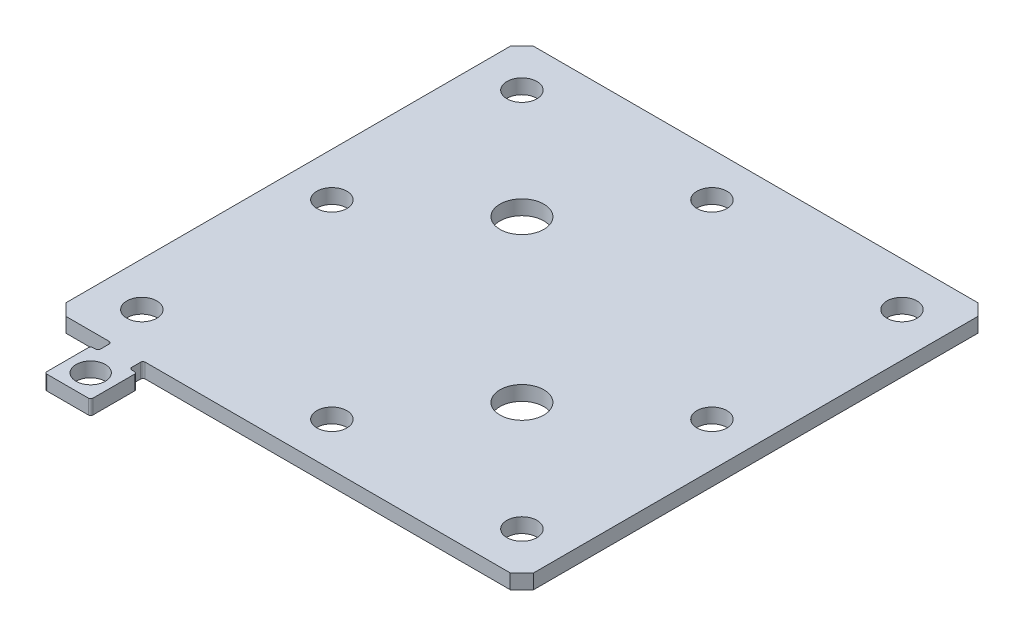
ISO-10303-21;
HEADER;
FILE_DESCRIPTION(('STEP AP214'),'2;1');
FILE_NAME('part.step','',(''),(''),'','','');
FILE_SCHEMA(('AUTOMOTIVE_DESIGN { 1 0 10303 214 1 1 1 1 }'));
ENDSEC;
DATA;
#1=APPLICATION_CONTEXT('core data for automotive mechanical design processes');
#2=APPLICATION_PROTOCOL_DEFINITION('international standard','automotive_design',2000,#1);
#3=PRODUCT_CONTEXT('',#1,'mechanical');
#4=PRODUCT('Part','Part','',(#3));
#5=PRODUCT_RELATED_PRODUCT_CATEGORY('part','',(#4));
#6=PRODUCT_DEFINITION_FORMATION('','',#4);
#7=PRODUCT_DEFINITION_CONTEXT('part definition',#1,'design');
#8=PRODUCT_DEFINITION('design','',#6,#7);
#9=PRODUCT_DEFINITION_SHAPE('','',#8);
#10=(LENGTH_UNIT() NAMED_UNIT(*) SI_UNIT(.MILLI.,.METRE.));
#11=(NAMED_UNIT(*) PLANE_ANGLE_UNIT() SI_UNIT($,.RADIAN.));
#12=(NAMED_UNIT(*) SI_UNIT($,.STERADIAN.) SOLID_ANGLE_UNIT());
#13=UNCERTAINTY_MEASURE_WITH_UNIT(LENGTH_MEASURE(1.E-05),#10,'distance_accuracy_value','');
#14=(GEOMETRIC_REPRESENTATION_CONTEXT(3) GLOBAL_UNCERTAINTY_ASSIGNED_CONTEXT((#13)) GLOBAL_UNIT_ASSIGNED_CONTEXT((#10,
#11,#12)) REPRESENTATION_CONTEXT('',''));
#15=CARTESIAN_POINT('',(0.,0.,0.));
#16=DIRECTION('',(0.,0.,1.));
#17=DIRECTION('',(1.,0.,0.));
#18=AXIS2_PLACEMENT_3D('',#15,#16,#17);
#19=CARTESIAN_POINT('',(-32.1361294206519,3.175,0.));
#20=DIRECTION('',(-1.,0.,0.));
#21=DIRECTION('',(0.,0.,1.));
#22=AXIS2_PLACEMENT_3D('',#19,#20,#21);
#23=PLANE('',#22);
#24=DIRECTION('',(0.,0.,-1.));
#25=VECTOR('',#24,1.);
#26=CARTESIAN_POINT('',(-32.1361294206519,3.175,0.));
#27=LINE('',#26,#25);
#28=CARTESIAN_POINT('',(-32.1361294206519,3.175,52.6144040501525));
#29=VERTEX_POINT('',#28);
#30=CARTESIAN_POINT('',(-32.1361294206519,3.175,50.676370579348));
#31=VERTEX_POINT('',#30);
#32=EDGE_CURVE('E212',#29,#31,#27,.T.);
#33=ORIENTED_EDGE('',*,*,#32,.F.);
#34=DIRECTION('',(0.,-1.,0.));
#35=VECTOR('',#34,1.);
#36=CARTESIAN_POINT('',(-32.1361294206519,3.175,52.6144040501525));
#37=LINE('',#36,#35);
#38=CARTESIAN_POINT('',(-32.1361294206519,0.,52.6144040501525));
#39=VERTEX_POINT('',#38);
#40=EDGE_CURVE('E384',#29,#39,#37,.T.);
#41=ORIENTED_EDGE('',*,*,#40,.T.);
#42=DIRECTION('',(0.,0.,-1.));
#43=VECTOR('',#42,1.);
#44=CARTESIAN_POINT('',(-32.1361294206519,0.,0.));
#45=LINE('',#44,#43);
#46=CARTESIAN_POINT('',(-32.1361294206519,0.,50.676370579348));
#47=VERTEX_POINT('',#46);
#48=EDGE_CURVE('E291',#39,#47,#45,.T.);
#49=ORIENTED_EDGE('',*,*,#48,.T.);
#50=DIRECTION('',(0.,-1.,0.));
#51=VECTOR('',#50,1.);
#52=CARTESIAN_POINT('',(-32.1361294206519,3.175,50.676370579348));
#53=LINE('',#52,#51);
#54=EDGE_CURVE('E382',#47,#31,#53,.F.);
#55=ORIENTED_EDGE('',*,*,#54,.T.);
#56=EDGE_LOOP('',(#33,#41,#49,#55));
#57=FACE_BOUND('',#56,.T.);
#58=ADVANCED_FACE('F39',(#57),#23,.F.);
#59=CARTESIAN_POINT('',(0.,3.175,50.176370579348));
#60=DIRECTION('',(0.,0.,-1.));
#61=DIRECTION('',(-1.,0.,0.));
#62=AXIS2_PLACEMENT_3D('',#59,#60,#61);
#63=PLANE('',#62);
#64=DIRECTION('',(1.,0.,0.));
#65=VECTOR('',#64,1.);
#66=CARTESIAN_POINT('',(0.,3.175,50.176370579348));
#67=LINE('',#66,#65);
#68=CARTESIAN_POINT('',(-31.6361294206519,3.175,50.176370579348));
#69=VERTEX_POINT('',#68);
#70=CARTESIAN_POINT('',(47.636370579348,3.175,50.176370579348));
#71=VERTEX_POINT('',#70);
#72=EDGE_CURVE('E199',#69,#71,#67,.T.);
#73=ORIENTED_EDGE('',*,*,#72,.F.);
#74=DIRECTION('',(0.,-1.,0.));
#75=VECTOR('',#74,1.);
#76=CARTESIAN_POINT('',(-31.6361294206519,0.,50.176370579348));
#77=LINE('',#76,#75);
#78=CARTESIAN_POINT('',(-31.6361294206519,0.,50.176370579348));
#79=VERTEX_POINT('',#78);
#80=EDGE_CURVE('E387',#69,#79,#77,.T.);
#81=ORIENTED_EDGE('',*,*,#80,.T.);
#82=DIRECTION('',(1.,0.,0.));
#83=VECTOR('',#82,1.);
#84=CARTESIAN_POINT('',(0.,0.,50.176370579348));
#85=LINE('',#84,#83);
#86=CARTESIAN_POINT('',(47.636370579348,0.,50.176370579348));
#87=VERTEX_POINT('',#86);
#88=EDGE_CURVE('E218',#79,#87,#85,.T.);
#89=ORIENTED_EDGE('',*,*,#88,.T.);
#90=DIRECTION('',(0.,-1.,0.));
#91=VECTOR('',#90,1.);
#92=CARTESIAN_POINT('',(47.636370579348,3.175,50.176370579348));
#93=LINE('',#92,#91);
#94=EDGE_CURVE('E215',#71,#87,#93,.T.);
#95=ORIENTED_EDGE('',*,*,#94,.F.);
#96=EDGE_LOOP('',(#73,#81,#89,#95));
#97=FACE_BOUND('',#96,.T.);
#98=ADVANCED_FACE('F216',(#97),#63,.F.);
#99=CARTESIAN_POINT('',(48.906370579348,3.175,48.906370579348));
#100=DIRECTION('',(-0.707106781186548,0.,-0.707106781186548));
#101=DIRECTION('',(-0.707106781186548,0.,0.707106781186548));
#102=AXIS2_PLACEMENT_3D('',#99,#100,#101);
#103=PLANE('',#102);
#104=DIRECTION('',(0.707106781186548,0.,-0.707106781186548));
#105=VECTOR('',#104,1.);
#106=CARTESIAN_POINT('',(48.906370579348,0.,48.906370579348));
#107=LINE('',#106,#105);
#108=CARTESIAN_POINT('',(50.176370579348,0.,47.636370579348));
#109=VERTEX_POINT('',#108);
#110=EDGE_CURVE('E295',#87,#109,#107,.T.);
#111=ORIENTED_EDGE('',*,*,#110,.T.);
#112=DIRECTION('',(0.,-1.,0.));
#113=VECTOR('',#112,1.);
#114=CARTESIAN_POINT('',(50.176370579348,3.175,47.636370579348));
#115=LINE('',#114,#113);
#116=CARTESIAN_POINT('',(50.176370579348,3.175,47.636370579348));
#117=VERTEX_POINT('',#116);
#118=EDGE_CURVE('E222',#117,#109,#115,.T.);
#119=ORIENTED_EDGE('',*,*,#118,.F.);
#120=DIRECTION('',(0.707106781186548,0.,-0.707106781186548));
#121=VECTOR('',#120,1.);
#122=CARTESIAN_POINT('',(48.906370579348,3.175,48.906370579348));
#123=LINE('',#122,#121);
#124=EDGE_CURVE('E204',#71,#117,#123,.T.);
#125=ORIENTED_EDGE('',*,*,#124,.F.);
#126=ORIENTED_EDGE('',*,*,#94,.T.);
#127=EDGE_LOOP('',(#111,#119,#125,#126));
#128=FACE_BOUND('',#127,.T.);
#129=ADVANCED_FACE('F224',(#128),#103,.F.);
#130=CARTESIAN_POINT('',(50.176370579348,3.175,0.));
#131=DIRECTION('',(-1.,0.,0.));
#132=DIRECTION('',(0.,0.,1.));
#133=AXIS2_PLACEMENT_3D('',#130,#131,#132);
#134=PLANE('',#133);
#135=DIRECTION('',(0.,0.,-1.));
#136=VECTOR('',#135,1.);
#137=CARTESIAN_POINT('',(50.176370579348,0.,0.));
#138=LINE('',#137,#136);
#139=CARTESIAN_POINT('',(50.176370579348,0.,-48.883629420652));
#140=VERTEX_POINT('',#139);
#141=EDGE_CURVE('E297',#109,#140,#138,.T.);
#142=ORIENTED_EDGE('',*,*,#141,.T.);
#143=DIRECTION('',(0.,-1.,0.));
#144=VECTOR('',#143,1.);
#145=CARTESIAN_POINT('',(50.176370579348,3.175,-48.883629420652));
#146=LINE('',#145,#144);
#147=CARTESIAN_POINT('',(50.176370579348,3.175,-48.883629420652));
#148=VERTEX_POINT('',#147);
#149=EDGE_CURVE('E346',#148,#140,#146,.T.);
#150=ORIENTED_EDGE('',*,*,#149,.F.);
#151=DIRECTION('',(0.,0.,-1.));
#152=VECTOR('',#151,1.);
#153=CARTESIAN_POINT('',(50.176370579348,3.175,0.));
#154=LINE('',#153,#152);
#155=EDGE_CURVE('E227',#117,#148,#154,.T.);
#156=ORIENTED_EDGE('',*,*,#155,.F.);
#157=ORIENTED_EDGE('',*,*,#118,.T.);
#158=EDGE_LOOP('',(#142,#150,#156,#157));
#159=FACE_BOUND('',#158,.T.);
#160=ADVANCED_FACE('F910',(#159),#134,.F.);
#161=CARTESIAN_POINT('',(49.53,3.175,-49.53));
#162=DIRECTION('',(0.707106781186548,0.,-0.707106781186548));
#163=DIRECTION('',(-0.707106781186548,0.,-0.707106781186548));
#164=AXIS2_PLACEMENT_3D('',#161,#162,#163);
#165=PLANE('',#164);
#166=DIRECTION('',(0.707106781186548,0.,0.707106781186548));
#167=VECTOR('',#166,1.);
#168=CARTESIAN_POINT('',(49.53,0.,-49.53));
#169=LINE('',#168,#167);
#170=CARTESIAN_POINT('',(47.636370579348,0.,-51.423629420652));
#171=VERTEX_POINT('',#170);
#172=EDGE_CURVE('E300',#171,#140,#169,.T.);
#173=ORIENTED_EDGE('',*,*,#172,.F.);
#174=DIRECTION('',(0.,-1.,0.));
#175=VECTOR('',#174,1.);
#176=CARTESIAN_POINT('',(47.636370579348,3.175,-51.423629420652));
#177=LINE('',#176,#175);
#178=CARTESIAN_POINT('',(47.636370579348,3.175,-51.423629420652));
#179=VERTEX_POINT('',#178);
#180=EDGE_CURVE('E344',#179,#171,#177,.T.);
#181=ORIENTED_EDGE('',*,*,#180,.F.);
#182=DIRECTION('',(0.707106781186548,0.,0.707106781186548));
#183=VECTOR('',#182,1.);
#184=CARTESIAN_POINT('',(49.53,3.175,-49.53));
#185=LINE('',#184,#183);
#186=EDGE_CURVE('E229',#179,#148,#185,.T.);
#187=ORIENTED_EDGE('',*,*,#186,.T.);
#188=ORIENTED_EDGE('',*,*,#149,.T.);
#189=EDGE_LOOP('',(#173,#181,#187,#188));
#190=FACE_BOUND('',#189,.T.);
#191=ADVANCED_FACE('F899',(#190),#165,.T.);
#192=CARTESIAN_POINT('',(0.,3.175,-51.423629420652));
#193=DIRECTION('',(0.,0.,-1.));
#194=DIRECTION('',(-1.,0.,0.));
#195=AXIS2_PLACEMENT_3D('',#192,#193,#194);
#196=PLANE('',#195);
#197=DIRECTION('',(1.,0.,0.));
#198=VECTOR('',#197,1.);
#199=CARTESIAN_POINT('',(0.,0.,-51.423629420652));
#200=LINE('',#199,#198);
#201=CARTESIAN_POINT('',(-48.883629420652,0.,-51.423629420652));
#202=VERTEX_POINT('',#201);
#203=EDGE_CURVE('E303',#202,#171,#200,.T.);
#204=ORIENTED_EDGE('',*,*,#203,.F.);
#205=DIRECTION('',(0.,-1.,0.));
#206=VECTOR('',#205,1.);
#207=CARTESIAN_POINT('',(-48.883629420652,3.175,-51.423629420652));
#208=LINE('',#207,#206);
#209=CARTESIAN_POINT('',(-48.883629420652,3.175,-51.423629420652));
#210=VERTEX_POINT('',#209);
#211=EDGE_CURVE('E342',#210,#202,#208,.T.);
#212=ORIENTED_EDGE('',*,*,#211,.F.);
#213=DIRECTION('',(1.,0.,0.));
#214=VECTOR('',#213,1.);
#215=CARTESIAN_POINT('',(0.,3.175,-51.423629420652));
#216=LINE('',#215,#214);
#217=EDGE_CURVE('E235',#210,#179,#216,.T.);
#218=ORIENTED_EDGE('',*,*,#217,.T.);
#219=ORIENTED_EDGE('',*,*,#180,.T.);
#220=EDGE_LOOP('',(#204,#212,#218,#219));
#221=FACE_BOUND('',#220,.T.);
#222=ADVANCED_FACE('F888',(#221),#196,.T.);
#223=CARTESIAN_POINT('',(-50.153629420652,3.175,-50.153629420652));
#224=DIRECTION('',(-0.707106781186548,0.,-0.707106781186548));
#225=DIRECTION('',(-0.707106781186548,0.,0.707106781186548));
#226=AXIS2_PLACEMENT_3D('',#223,#224,#225);
#227=PLANE('',#226);
#228=DIRECTION('',(0.707106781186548,0.,-0.707106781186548));
#229=VECTOR('',#228,1.);
#230=CARTESIAN_POINT('',(-50.153629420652,0.,-50.153629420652));
#231=LINE('',#230,#229);
#232=CARTESIAN_POINT('',(-51.423629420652,0.,-48.883629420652));
#233=VERTEX_POINT('',#232);
#234=EDGE_CURVE('E306',#233,#202,#231,.T.);
#235=ORIENTED_EDGE('',*,*,#234,.F.);
#236=DIRECTION('',(0.,-1.,0.));
#237=VECTOR('',#236,1.);
#238=CARTESIAN_POINT('',(-51.423629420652,3.175,-48.883629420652));
#239=LINE('',#238,#237);
#240=CARTESIAN_POINT('',(-51.423629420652,3.175,-48.883629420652));
#241=VERTEX_POINT('',#240);
#242=EDGE_CURVE('E340',#241,#233,#239,.T.);
#243=ORIENTED_EDGE('',*,*,#242,.F.);
#244=DIRECTION('',(0.707106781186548,0.,-0.707106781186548));
#245=VECTOR('',#244,1.);
#246=CARTESIAN_POINT('',(-50.153629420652,3.175,-50.153629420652));
#247=LINE('',#246,#245);
#248=EDGE_CURVE('E238',#241,#210,#247,.T.);
#249=ORIENTED_EDGE('',*,*,#248,.T.);
#250=ORIENTED_EDGE('',*,*,#211,.T.);
#251=EDGE_LOOP('',(#235,#243,#249,#250));
#252=FACE_BOUND('',#251,.T.);
#253=ADVANCED_FACE('F877',(#252),#227,.T.);
#254=CARTESIAN_POINT('',(-51.423629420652,3.175,0.));
#255=DIRECTION('',(-1.,0.,0.));
#256=DIRECTION('',(0.,0.,1.));
#257=AXIS2_PLACEMENT_3D('',#254,#255,#256);
#258=PLANE('',#257);
#259=DIRECTION('',(0.,0.,-1.));
#260=VECTOR('',#259,1.);
#261=CARTESIAN_POINT('',(-51.423629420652,0.,0.));
#262=LINE('',#261,#260);
#263=CARTESIAN_POINT('',(-51.423629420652,0.,47.636370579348));
#264=VERTEX_POINT('',#263);
#265=EDGE_CURVE('E309',#264,#233,#262,.T.);
#266=ORIENTED_EDGE('',*,*,#265,.F.);
#267=DIRECTION('',(0.,-1.,0.));
#268=VECTOR('',#267,1.);
#269=CARTESIAN_POINT('',(-51.423629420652,3.175,47.636370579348));
#270=LINE('',#269,#268);
#271=CARTESIAN_POINT('',(-51.423629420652,3.175,47.636370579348));
#272=VERTEX_POINT('',#271);
#273=EDGE_CURVE('E338',#272,#264,#270,.T.);
#274=ORIENTED_EDGE('',*,*,#273,.F.);
#275=DIRECTION('',(0.,0.,-1.));
#276=VECTOR('',#275,1.);
#277=CARTESIAN_POINT('',(-51.423629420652,3.175,0.));
#278=LINE('',#277,#276);
#279=EDGE_CURVE('E241',#272,#241,#278,.T.);
#280=ORIENTED_EDGE('',*,*,#279,.T.);
#281=ORIENTED_EDGE('',*,*,#242,.T.);
#282=EDGE_LOOP('',(#266,#274,#280,#281));
#283=FACE_BOUND('',#282,.T.);
#284=ADVANCED_FACE('F866',(#283),#258,.T.);
#285=CARTESIAN_POINT('',(-49.53,3.175,49.53));
#286=DIRECTION('',(0.707106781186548,0.,-0.707106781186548));
#287=DIRECTION('',(-0.707106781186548,0.,-0.707106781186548));
#288=AXIS2_PLACEMENT_3D('',#285,#286,#287);
#289=PLANE('',#288);
#290=DIRECTION('',(0.707106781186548,0.,0.707106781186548));
#291=VECTOR('',#290,1.);
#292=CARTESIAN_POINT('',(-49.53,0.,49.53));
#293=LINE('',#292,#291);
#294=CARTESIAN_POINT('',(-48.883629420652,0.,50.176370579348));
#295=VERTEX_POINT('',#294);
#296=EDGE_CURVE('E312',#264,#295,#293,.T.);
#297=ORIENTED_EDGE('',*,*,#296,.T.);
#298=DIRECTION('',(0.,-1.,0.));
#299=VECTOR('',#298,1.);
#300=CARTESIAN_POINT('',(-48.883629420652,3.175,50.176370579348));
#301=LINE('',#300,#299);
#302=CARTESIAN_POINT('',(-48.883629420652,3.175,50.176370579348));
#303=VERTEX_POINT('',#302);
#304=EDGE_CURVE('E265',#303,#295,#301,.T.);
#305=ORIENTED_EDGE('',*,*,#304,.F.);
#306=DIRECTION('',(0.707106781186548,0.,0.707106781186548));
#307=VECTOR('',#306,1.);
#308=CARTESIAN_POINT('',(-49.53,3.175,49.53));
#309=LINE('',#308,#307);
#310=EDGE_CURVE('E244',#272,#303,#309,.T.);
#311=ORIENTED_EDGE('',*,*,#310,.F.);
#312=ORIENTED_EDGE('',*,*,#273,.T.);
#313=EDGE_LOOP('',(#297,#305,#311,#312));
#314=FACE_BOUND('',#313,.T.);
#315=ADVANCED_FACE('F856',(#314),#289,.F.);
#316=CARTESIAN_POINT('',(0.,3.175,50.176370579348));
#317=DIRECTION('',(0.,0.,-1.));
#318=DIRECTION('',(-1.,0.,0.));
#319=AXIS2_PLACEMENT_3D('',#316,#317,#318);
#320=PLANE('',#319);
#321=DIRECTION('',(1.,0.,0.));
#322=VECTOR('',#321,1.);
#323=CARTESIAN_POINT('',(0.,0.,50.176370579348));
#324=LINE('',#323,#322);
#325=CARTESIAN_POINT('',(-39.461129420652,0.,50.176370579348));
#326=VERTEX_POINT('',#325);
#327=EDGE_CURVE('E314',#295,#326,#324,.T.);
#328=ORIENTED_EDGE('',*,*,#327,.T.);
#329=DIRECTION('',(0.,-1.,0.));
#330=VECTOR('',#329,1.);
#331=CARTESIAN_POINT('',(-39.461129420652,3.175,50.176370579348));
#332=LINE('',#331,#330);
#333=CARTESIAN_POINT('',(-39.461129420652,3.175,50.176370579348));
#334=VERTEX_POINT('',#333);
#335=EDGE_CURVE('E399',#326,#334,#332,.F.);
#336=ORIENTED_EDGE('',*,*,#335,.T.);
#337=DIRECTION('',(1.,0.,0.));
#338=VECTOR('',#337,1.);
#339=CARTESIAN_POINT('',(0.,3.175,50.176370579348));
#340=LINE('',#339,#338);
#341=EDGE_CURVE('E246',#303,#334,#340,.T.);
#342=ORIENTED_EDGE('',*,*,#341,.F.);
#343=ORIENTED_EDGE('',*,*,#304,.T.);
#344=EDGE_LOOP('',(#328,#336,#342,#343));
#345=FACE_BOUND('',#344,.T.);
#346=ADVANCED_FACE('F421',(#345),#320,.F.);
#347=CARTESIAN_POINT('',(-38.961129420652,3.175,0.));
#348=DIRECTION('',(-1.,0.,0.));
#349=DIRECTION('',(0.,0.,1.));
#350=AXIS2_PLACEMENT_3D('',#347,#348,#349);
#351=PLANE('',#350);
#352=DIRECTION('',(0.,0.,-1.));
#353=VECTOR('',#352,1.);
#354=CARTESIAN_POINT('',(-38.961129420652,0.,0.));
#355=LINE('',#354,#353);
#356=CARTESIAN_POINT('',(-38.961129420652,0.,52.6144040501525));
#357=VERTEX_POINT('',#356);
#358=CARTESIAN_POINT('',(-38.961129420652,0.,50.676370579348));
#359=VERTEX_POINT('',#358);
#360=EDGE_CURVE('E317',#357,#359,#355,.T.);
#361=ORIENTED_EDGE('',*,*,#360,.F.);
#362=DIRECTION('',(0.,-1.,0.));
#363=VECTOR('',#362,1.);
#364=CARTESIAN_POINT('',(-38.961129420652,3.175,52.6144040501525));
#365=LINE('',#364,#363);
#366=CARTESIAN_POINT('',(-38.961129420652,3.175,52.6144040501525));
#367=VERTEX_POINT('',#366);
#368=EDGE_CURVE('E397',#357,#367,#365,.F.);
#369=ORIENTED_EDGE('',*,*,#368,.T.);
#370=DIRECTION('',(0.,0.,-1.));
#371=VECTOR('',#370,1.);
#372=CARTESIAN_POINT('',(-38.961129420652,3.175,0.));
#373=LINE('',#372,#371);
#374=CARTESIAN_POINT('',(-38.961129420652,3.175,50.676370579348));
#375=VERTEX_POINT('',#374);
#376=EDGE_CURVE('E249',#367,#375,#373,.T.);
#377=ORIENTED_EDGE('',*,*,#376,.T.);
#378=DIRECTION('',(0.,-1.,0.));
#379=VECTOR('',#378,1.);
#380=CARTESIAN_POINT('',(-38.961129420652,3.175,50.676370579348));
#381=LINE('',#380,#379);
#382=EDGE_CURVE('E394',#375,#359,#381,.T.);
#383=ORIENTED_EDGE('',*,*,#382,.T.);
#384=EDGE_LOOP('',(#361,#369,#377,#383));
#385=FACE_BOUND('',#384,.T.);
#386=ADVANCED_FACE('F428',(#385),#351,.T.);
#387=CARTESIAN_POINT('',(0.,3.175,53.1144040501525));
#388=DIRECTION('',(0.,0.,-1.));
#389=DIRECTION('',(-1.,0.,0.));
#390=AXIS2_PLACEMENT_3D('',#387,#388,#389);
#391=PLANE('',#390);
#392=DIRECTION('',(1.,0.,0.));
#393=VECTOR('',#392,1.);
#394=CARTESIAN_POINT('',(0.,0.,53.1144040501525));
#395=LINE('',#394,#393);
#396=CARTESIAN_POINT('',(-40.048629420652,0.,53.1144040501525));
#397=VERTEX_POINT('',#396);
#398=CARTESIAN_POINT('',(-39.461129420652,0.,53.1144040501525));
#399=VERTEX_POINT('',#398);
#400=EDGE_CURVE('E320',#397,#399,#395,.T.);
#401=ORIENTED_EDGE('',*,*,#400,.F.);
#402=DIRECTION('',(0.,-1.,0.));
#403=VECTOR('',#402,1.);
#404=CARTESIAN_POINT('',(-40.048629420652,3.175,53.1144040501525));
#405=LINE('',#404,#403);
#406=CARTESIAN_POINT('',(-40.048629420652,3.175,53.1144040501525));
#407=VERTEX_POINT('',#406);
#408=EDGE_CURVE('E392',#397,#407,#405,.F.);
#409=ORIENTED_EDGE('',*,*,#408,.T.);
#410=DIRECTION('',(1.,0.,0.));
#411=VECTOR('',#410,1.);
#412=CARTESIAN_POINT('',(0.,3.175,53.1144040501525));
#413=LINE('',#412,#411);
#414=CARTESIAN_POINT('',(-39.461129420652,3.175,53.1144040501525));
#415=VERTEX_POINT('',#414);
#416=EDGE_CURVE('E252',#407,#415,#413,.T.);
#417=ORIENTED_EDGE('',*,*,#416,.T.);
#418=DIRECTION('',(0.,-1.,0.));
#419=VECTOR('',#418,1.);
#420=CARTESIAN_POINT('',(-39.461129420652,0.,53.1144040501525));
#421=LINE('',#420,#419);
#422=EDGE_CURVE('E389',#415,#399,#421,.T.);
#423=ORIENTED_EDGE('',*,*,#422,.T.);
#424=EDGE_LOOP('',(#401,#409,#417,#423));
#425=FACE_BOUND('',#424,.T.);
#426=ADVANCED_FACE('F437',(#425),#391,.T.);
#427=CARTESIAN_POINT('',(-40.548629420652,3.175,0.));
#428=DIRECTION('',(1.,0.,0.));
#429=DIRECTION('',(0.,0.,-1.));
#430=AXIS2_PLACEMENT_3D('',#427,#428,#429);
#431=PLANE('',#430);
#432=DIRECTION('',(0.,0.,1.));
#433=VECTOR('',#432,1.);
#434=CARTESIAN_POINT('',(-40.548629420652,0.,0.));
#435=LINE('',#434,#433);
#436=CARTESIAN_POINT('',(-40.548629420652,0.,53.6144040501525));
#437=VERTEX_POINT('',#436);
#438=CARTESIAN_POINT('',(-40.548629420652,0.,62.6144040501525));
#439=VERTEX_POINT('',#438);
#440=EDGE_CURVE('E323',#437,#439,#435,.T.);
#441=ORIENTED_EDGE('',*,*,#440,.T.);
#442=DIRECTION('',(0.,-1.,0.));
#443=VECTOR('',#442,1.);
#444=CARTESIAN_POINT('',(-40.548629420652,3.175,62.6144040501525));
#445=LINE('',#444,#443);
#446=CARTESIAN_POINT('',(-40.548629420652,3.175,62.6144040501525));
#447=VERTEX_POINT('',#446);
#448=EDGE_CURVE('E364',#439,#447,#445,.F.);
#449=ORIENTED_EDGE('',*,*,#448,.T.);
#450=DIRECTION('',(0.,0.,1.));
#451=VECTOR('',#450,1.);
#452=CARTESIAN_POINT('',(-40.548629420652,3.175,0.));
#453=LINE('',#452,#451);
#454=CARTESIAN_POINT('',(-40.548629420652,3.175,53.6144040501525));
#455=VERTEX_POINT('',#454);
#456=EDGE_CURVE('E255',#455,#447,#453,.T.);
#457=ORIENTED_EDGE('',*,*,#456,.F.);
#458=DIRECTION('',(0.,-1.,0.));
#459=VECTOR('',#458,1.);
#460=CARTESIAN_POINT('',(-40.548629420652,0.,53.6144040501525));
#461=LINE('',#460,#459);
#462=EDGE_CURVE('E361',#455,#437,#461,.T.);
#463=ORIENTED_EDGE('',*,*,#462,.T.);
#464=EDGE_LOOP('',(#441,#449,#457,#463));
#465=FACE_BOUND('',#464,.T.);
#466=ADVANCED_FACE('F445',(#465),#431,.F.);
#467=CARTESIAN_POINT('',(0.,3.175,63.1144040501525));
#468=DIRECTION('',(0.,0.,-1.));
#469=DIRECTION('',(-1.,0.,0.));
#470=AXIS2_PLACEMENT_3D('',#467,#468,#469);
#471=PLANE('',#470);
#472=DIRECTION('',(1.,0.,0.));
#473=VECTOR('',#472,1.);
#474=CARTESIAN_POINT('',(0.,3.175,63.1144040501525));
#475=LINE('',#474,#473);
#476=CARTESIAN_POINT('',(-40.048629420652,3.175,63.1144040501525));
#477=VERTEX_POINT('',#476);
#478=CARTESIAN_POINT('',(-31.048629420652,3.175,63.1144040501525));
#479=VERTEX_POINT('',#478);
#480=EDGE_CURVE('E257',#477,#479,#475,.T.);
#481=ORIENTED_EDGE('',*,*,#480,.F.);
#482=DIRECTION('',(0.,-1.,0.));
#483=VECTOR('',#482,1.);
#484=CARTESIAN_POINT('',(-40.048629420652,3.175,63.1144040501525));
#485=LINE('',#484,#483);
#486=CARTESIAN_POINT('',(-40.048629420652,0.,63.1144040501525));
#487=VERTEX_POINT('',#486);
#488=EDGE_CURVE('E350',#477,#487,#485,.T.);
#489=ORIENTED_EDGE('',*,*,#488,.T.);
#490=DIRECTION('',(1.,0.,0.));
#491=VECTOR('',#490,1.);
#492=CARTESIAN_POINT('',(0.,0.,63.1144040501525));
#493=LINE('',#492,#491);
#494=CARTESIAN_POINT('',(-31.048629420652,0.,63.1144040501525));
#495=VERTEX_POINT('',#494);
#496=EDGE_CURVE('E326',#487,#495,#493,.T.);
#497=ORIENTED_EDGE('',*,*,#496,.T.);
#498=DIRECTION('',(0.,-1.,0.));
#499=VECTOR('',#498,1.);
#500=CARTESIAN_POINT('',(-31.048629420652,3.175,63.1144040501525));
#501=LINE('',#500,#499);
#502=EDGE_CURVE('E221',#495,#479,#501,.F.);
#503=ORIENTED_EDGE('',*,*,#502,.T.);
#504=EDGE_LOOP('',(#481,#489,#497,#503));
#505=FACE_BOUND('',#504,.T.);
#506=ADVANCED_FACE('F454',(#505),#471,.F.);
#507=CARTESIAN_POINT('',(-30.548629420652,3.175,0.));
#508=DIRECTION('',(1.,0.,0.));
#509=DIRECTION('',(0.,0.,-1.));
#510=AXIS2_PLACEMENT_3D('',#507,#508,#509);
#511=PLANE('',#510);
#512=DIRECTION('',(0.,0.,1.));
#513=VECTOR('',#512,1.);
#514=CARTESIAN_POINT('',(-30.548629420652,3.175,0.));
#515=LINE('',#514,#513);
#516=CARTESIAN_POINT('',(-30.548629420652,3.175,53.6144040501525));
#517=VERTEX_POINT('',#516);
#518=CARTESIAN_POINT('',(-30.548629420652,3.175,62.6144040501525));
#519=VERTEX_POINT('',#518);
#520=EDGE_CURVE('E260',#517,#519,#515,.T.);
#521=ORIENTED_EDGE('',*,*,#520,.T.);
#522=DIRECTION('',(0.,-1.,0.));
#523=VECTOR('',#522,1.);
#524=CARTESIAN_POINT('',(-30.548629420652,0.,62.6144040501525));
#525=LINE('',#524,#523);
#526=CARTESIAN_POINT('',(-30.548629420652,0.,62.6144040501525));
#527=VERTEX_POINT('',#526);
#528=EDGE_CURVE('E375',#519,#527,#525,.T.);
#529=ORIENTED_EDGE('',*,*,#528,.T.);
#530=DIRECTION('',(0.,0.,1.));
#531=VECTOR('',#530,1.);
#532=CARTESIAN_POINT('',(-30.548629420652,0.,0.));
#533=LINE('',#532,#531);
#534=CARTESIAN_POINT('',(-30.548629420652,0.,53.6144040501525));
#535=VERTEX_POINT('',#534);
#536=EDGE_CURVE('E329',#535,#527,#533,.T.);
#537=ORIENTED_EDGE('',*,*,#536,.F.);
#538=DIRECTION('',(0.,-1.,0.));
#539=VECTOR('',#538,1.);
#540=CARTESIAN_POINT('',(-30.548629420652,3.175,53.6144040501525));
#541=LINE('',#540,#539);
#542=EDGE_CURVE('E373',#535,#517,#541,.F.);
#543=ORIENTED_EDGE('',*,*,#542,.T.);
#544=EDGE_LOOP('',(#521,#529,#537,#543));
#545=FACE_BOUND('',#544,.T.);
#546=ADVANCED_FACE('F460',(#545),#511,.T.);
#547=CARTESIAN_POINT('',(-41.898629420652,3.175,-41.898629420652));
#548=DIRECTION('',(0.,-1.,0.));
#549=DIRECTION('',(0.,0.,-1.));
#550=AXIS2_PLACEMENT_3D('',#547,#548,#549);
#551=CYLINDRICAL_SURFACE('',#550,3.2639);
#552=CARTESIAN_POINT('',(-41.898629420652,3.175,-41.898629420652));
#553=DIRECTION('',(0.,1.,0.));
#554=DIRECTION('',(0.,0.,1.));
#555=AXIS2_PLACEMENT_3D('',#552,#553,#554);
#556=CIRCLE('',#555,3.2639);
#557=CARTESIAN_POINT('',(-41.898629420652,3.175,-38.634729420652));
#558=VERTEX_POINT('',#557);
#559=EDGE_CURVE('E475',#558,#558,#556,.T.);
#560=ORIENTED_EDGE('',*,*,#559,.T.);
#561=EDGE_LOOP('',(#560));
#562=FACE_BOUND('',#561,.T.);
#563=CARTESIAN_POINT('',(-41.898629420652,0.,-41.898629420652));
#564=DIRECTION('',(0.,1.,0.));
#565=DIRECTION('',(0.,0.,1.));
#566=AXIS2_PLACEMENT_3D('',#563,#564,#565);
#567=CIRCLE('',#566,3.2639);
#568=CARTESIAN_POINT('',(-41.898629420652,0.,-38.634729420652));
#569=VERTEX_POINT('',#568);
#570=EDGE_CURVE('E288',#569,#569,#567,.T.);
#571=ORIENTED_EDGE('',*,*,#570,.F.);
#572=EDGE_LOOP('',(#571));
#573=FACE_BOUND('',#572,.T.);
#574=ADVANCED_FACE('F549',(#562,#573),#551,.F.);
#575=CARTESIAN_POINT('',(40.651370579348,3.175,-41.898629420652));
#576=DIRECTION('',(0.,-1.,0.));
#577=DIRECTION('',(0.,0.,-1.));
#578=AXIS2_PLACEMENT_3D('',#575,#576,#577);
#579=CYLINDRICAL_SURFACE('',#578,3.2639);
#580=CARTESIAN_POINT('',(40.651370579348,3.175,-41.898629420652));
#581=DIRECTION('',(0.,1.,0.));
#582=DIRECTION('',(0.,0.,1.));
#583=AXIS2_PLACEMENT_3D('',#580,#581,#582);
#584=CIRCLE('',#583,3.2639);
#585=CARTESIAN_POINT('',(40.651370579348,3.175,-38.634729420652));
#586=VERTEX_POINT('',#585);
#587=EDGE_CURVE('E477',#586,#586,#584,.T.);
#588=ORIENTED_EDGE('',*,*,#587,.T.);
#589=EDGE_LOOP('',(#588));
#590=FACE_BOUND('',#589,.T.);
#591=CARTESIAN_POINT('',(40.651370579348,0.,-41.898629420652));
#592=DIRECTION('',(0.,1.,0.));
#593=DIRECTION('',(0.,0.,1.));
#594=AXIS2_PLACEMENT_3D('',#591,#592,#593);
#595=CIRCLE('',#594,3.2639);
#596=CARTESIAN_POINT('',(40.651370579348,0.,-38.634729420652));
#597=VERTEX_POINT('',#596);
#598=EDGE_CURVE('E285',#597,#597,#595,.T.);
#599=ORIENTED_EDGE('',*,*,#598,.F.);
#600=EDGE_LOOP('',(#599));
#601=FACE_BOUND('',#600,.T.);
#602=ADVANCED_FACE('F552',(#590,#601),#579,.F.);
#603=CARTESIAN_POINT('',(40.651370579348,3.175,-0.623629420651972));
#604=DIRECTION('',(0.,-1.,0.));
#605=DIRECTION('',(0.,0.,-1.));
#606=AXIS2_PLACEMENT_3D('',#603,#604,#605);
#607=CYLINDRICAL_SURFACE('',#606,3.2639);
#608=CARTESIAN_POINT('',(40.651370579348,3.175,-0.623629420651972));
#609=DIRECTION('',(0.,1.,0.));
#610=DIRECTION('',(0.,0.,1.));
#611=AXIS2_PLACEMENT_3D('',#608,#609,#610);
#612=CIRCLE('',#611,3.2639);
#613=CARTESIAN_POINT('',(40.651370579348,3.175,2.64027057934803));
#614=VERTEX_POINT('',#613);
#615=EDGE_CURVE('E482',#614,#614,#612,.T.);
#616=ORIENTED_EDGE('',*,*,#615,.T.);
#617=EDGE_LOOP('',(#616));
#618=FACE_BOUND('',#617,.T.);
#619=CARTESIAN_POINT('',(40.651370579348,0.,-0.623629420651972));
#620=DIRECTION('',(0.,1.,0.));
#621=DIRECTION('',(0.,0.,1.));
#622=AXIS2_PLACEMENT_3D('',#619,#620,#621);
#623=CIRCLE('',#622,3.2639);
#624=CARTESIAN_POINT('',(40.651370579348,0.,2.64027057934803));
#625=VERTEX_POINT('',#624);
#626=EDGE_CURVE('E282',#625,#625,#623,.T.);
#627=ORIENTED_EDGE('',*,*,#626,.F.);
#628=EDGE_LOOP('',(#627));
#629=FACE_BOUND('',#628,.T.);
#630=ADVANCED_FACE('F573',(#618,#629),#607,.F.);
#631=CARTESIAN_POINT('',(40.651370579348,3.175,40.651370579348));
#632=DIRECTION('',(0.,-1.,0.));
#633=DIRECTION('',(0.,0.,-1.));
#634=AXIS2_PLACEMENT_3D('',#631,#632,#633);
#635=CYLINDRICAL_SURFACE('',#634,3.2639);
#636=CARTESIAN_POINT('',(40.651370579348,3.175,40.651370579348));
#637=DIRECTION('',(0.,1.,0.));
#638=DIRECTION('',(0.,0.,1.));
#639=AXIS2_PLACEMENT_3D('',#636,#637,#638);
#640=CIRCLE('',#639,3.2639);
#641=CARTESIAN_POINT('',(40.651370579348,3.175,43.915270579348));
#642=VERTEX_POINT('',#641);
#643=EDGE_CURVE('E485',#642,#642,#640,.T.);
#644=ORIENTED_EDGE('',*,*,#643,.T.);
#645=EDGE_LOOP('',(#644));
#646=FACE_BOUND('',#645,.T.);
#647=CARTESIAN_POINT('',(40.651370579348,0.,40.651370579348));
#648=DIRECTION('',(0.,1.,0.));
#649=DIRECTION('',(0.,0.,1.));
#650=AXIS2_PLACEMENT_3D('',#647,#648,#649);
#651=CIRCLE('',#650,3.2639);
#652=CARTESIAN_POINT('',(40.651370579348,0.,43.915270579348));
#653=VERTEX_POINT('',#652);
#654=EDGE_CURVE('E279',#653,#653,#651,.T.);
#655=ORIENTED_EDGE('',*,*,#654,.F.);
#656=EDGE_LOOP('',(#655));
#657=FACE_BOUND('',#656,.T.);
#658=ADVANCED_FACE('F577',(#646,#657),#635,.F.);
#659=CARTESIAN_POINT('',(-41.898629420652,3.175,40.651370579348));
#660=DIRECTION('',(0.,-1.,0.));
#661=DIRECTION('',(0.,0.,-1.));
#662=AXIS2_PLACEMENT_3D('',#659,#660,#661);
#663=CYLINDRICAL_SURFACE('',#662,3.2639);
#664=CARTESIAN_POINT('',(-41.898629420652,3.175,40.651370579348));
#665=DIRECTION('',(0.,1.,0.));
#666=DIRECTION('',(0.,0.,1.));
#667=AXIS2_PLACEMENT_3D('',#664,#665,#666);
#668=CIRCLE('',#667,3.2639);
#669=CARTESIAN_POINT('',(-41.898629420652,3.175,43.915270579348));
#670=VERTEX_POINT('',#669);
#671=EDGE_CURVE('E488',#670,#670,#668,.T.);
#672=ORIENTED_EDGE('',*,*,#671,.T.);
#673=EDGE_LOOP('',(#672));
#674=FACE_BOUND('',#673,.T.);
#675=CARTESIAN_POINT('',(-41.898629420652,0.,40.651370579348));
#676=DIRECTION('',(0.,1.,0.));
#677=DIRECTION('',(0.,0.,1.));
#678=AXIS2_PLACEMENT_3D('',#675,#676,#677);
#679=CIRCLE('',#678,3.2639);
#680=CARTESIAN_POINT('',(-41.898629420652,0.,43.915270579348));
#681=VERTEX_POINT('',#680);
#682=EDGE_CURVE('E276',#681,#681,#679,.T.);
#683=ORIENTED_EDGE('',*,*,#682,.F.);
#684=EDGE_LOOP('',(#683));
#685=FACE_BOUND('',#684,.T.);
#686=ADVANCED_FACE('F581',(#674,#685),#663,.F.);
#687=CARTESIAN_POINT('',(-41.898629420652,3.175,-0.623629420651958));
#688=DIRECTION('',(0.,-1.,0.));
#689=DIRECTION('',(0.,0.,-1.));
#690=AXIS2_PLACEMENT_3D('',#687,#688,#689);
#691=CYLINDRICAL_SURFACE('',#690,3.2639);
#692=CARTESIAN_POINT('',(-41.898629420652,3.175,-0.623629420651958));
#693=DIRECTION('',(0.,1.,0.));
#694=DIRECTION('',(0.,0.,1.));
#695=AXIS2_PLACEMENT_3D('',#692,#693,#694);
#696=CIRCLE('',#695,3.2639);
#697=CARTESIAN_POINT('',(-41.898629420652,3.175,2.64027057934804));
#698=VERTEX_POINT('',#697);
#699=EDGE_CURVE('E491',#698,#698,#696,.T.);
#700=ORIENTED_EDGE('',*,*,#699,.T.);
#701=EDGE_LOOP('',(#700));
#702=FACE_BOUND('',#701,.T.);
#703=CARTESIAN_POINT('',(-41.898629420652,0.,-0.623629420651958));
#704=DIRECTION('',(0.,1.,0.));
#705=DIRECTION('',(0.,0.,1.));
#706=AXIS2_PLACEMENT_3D('',#703,#704,#705);
#707=CIRCLE('',#706,3.2639);
#708=CARTESIAN_POINT('',(-41.898629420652,0.,2.64027057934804));
#709=VERTEX_POINT('',#708);
#710=EDGE_CURVE('E273',#709,#709,#707,.T.);
#711=ORIENTED_EDGE('',*,*,#710,.F.);
#712=EDGE_LOOP('',(#711));
#713=FACE_BOUND('',#712,.T.);
#714=ADVANCED_FACE('F585',(#702,#713),#691,.F.);
#715=CARTESIAN_POINT('',(-0.623629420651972,3.175,-41.898629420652));
#716=DIRECTION('',(0.,-1.,0.));
#717=DIRECTION('',(0.,0.,-1.));
#718=AXIS2_PLACEMENT_3D('',#715,#716,#717);
#719=CYLINDRICAL_SURFACE('',#718,3.2639);
#720=CARTESIAN_POINT('',(-0.623629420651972,3.175,-41.898629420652));
#721=DIRECTION('',(0.,1.,0.));
#722=DIRECTION('',(0.,0.,1.));
#723=AXIS2_PLACEMENT_3D('',#720,#721,#722);
#724=CIRCLE('',#723,3.2639);
#725=CARTESIAN_POINT('',(-0.623629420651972,3.175,-38.634729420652));
#726=VERTEX_POINT('',#725);
#727=EDGE_CURVE('E494',#726,#726,#724,.T.);
#728=ORIENTED_EDGE('',*,*,#727,.T.);
#729=EDGE_LOOP('',(#728));
#730=FACE_BOUND('',#729,.T.);
#731=CARTESIAN_POINT('',(-0.623629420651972,0.,-41.898629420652));
#732=DIRECTION('',(0.,1.,0.));
#733=DIRECTION('',(0.,0.,1.));
#734=AXIS2_PLACEMENT_3D('',#731,#732,#733);
#735=CIRCLE('',#734,3.2639);
#736=CARTESIAN_POINT('',(-0.623629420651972,0.,-38.634729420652));
#737=VERTEX_POINT('',#736);
#738=EDGE_CURVE('E269',#737,#737,#735,.T.);
#739=ORIENTED_EDGE('',*,*,#738,.F.);
#740=EDGE_LOOP('',(#739));
#741=FACE_BOUND('',#740,.T.);
#742=ADVANCED_FACE('F589',(#730,#741),#719,.F.);
#743=CARTESIAN_POINT('',(-0.623629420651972,3.175,40.651370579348));
#744=DIRECTION('',(0.,-1.,0.));
#745=DIRECTION('',(0.,0.,-1.));
#746=AXIS2_PLACEMENT_3D('',#743,#744,#745);
#747=CYLINDRICAL_SURFACE('',#746,3.2639);
#748=CARTESIAN_POINT('',(-0.623629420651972,3.175,40.651370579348));
#749=DIRECTION('',(0.,1.,0.));
#750=DIRECTION('',(0.,0.,1.));
#751=AXIS2_PLACEMENT_3D('',#748,#749,#750);
#752=CIRCLE('',#751,3.2639);
#753=CARTESIAN_POINT('',(-0.623629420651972,3.175,43.915270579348));
#754=VERTEX_POINT('',#753);
#755=EDGE_CURVE('E335',#754,#754,#752,.T.);
#756=ORIENTED_EDGE('',*,*,#755,.T.);
#757=EDGE_LOOP('',(#756));
#758=FACE_BOUND('',#757,.T.);
#759=CARTESIAN_POINT('',(-0.623629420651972,0.,40.651370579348));
#760=DIRECTION('',(0.,1.,0.));
#761=DIRECTION('',(0.,0.,1.));
#762=AXIS2_PLACEMENT_3D('',#759,#760,#761);
#763=CIRCLE('',#762,3.2639);
#764=CARTESIAN_POINT('',(-0.623629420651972,0.,43.915270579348));
#765=VERTEX_POINT('',#764);
#766=EDGE_CURVE('E266',#765,#765,#763,.T.);
#767=ORIENTED_EDGE('',*,*,#766,.F.);
#768=EDGE_LOOP('',(#767));
#769=FACE_BOUND('',#768,.T.);
#770=ADVANCED_FACE('F593',(#758,#769),#747,.F.);
#771=CARTESIAN_POINT('',(0.,3.175,53.1144040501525));
#772=DIRECTION('',(0.,0.,-1.));
#773=DIRECTION('',(-1.,0.,0.));
#774=AXIS2_PLACEMENT_3D('',#771,#772,#773);
#775=PLANE('',#774);
#776=DIRECTION('',(1.,0.,0.));
#777=VECTOR('',#776,1.);
#778=CARTESIAN_POINT('',(0.,3.175,53.1144040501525));
#779=LINE('',#778,#777);
#780=CARTESIAN_POINT('',(-31.6361294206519,3.175,53.1144040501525));
#781=VERTEX_POINT('',#780);
#782=CARTESIAN_POINT('',(-31.048629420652,3.175,53.1144040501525));
#783=VERTEX_POINT('',#782);
#784=EDGE_CURVE('E263',#781,#783,#779,.T.);
#785=ORIENTED_EDGE('',*,*,#784,.T.);
#786=DIRECTION('',(0.,-1.,0.));
#787=VECTOR('',#786,1.);
#788=CARTESIAN_POINT('',(-31.048629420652,3.175,53.1144040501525));
#789=LINE('',#788,#787);
#790=CARTESIAN_POINT('',(-31.048629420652,0.,53.1144040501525));
#791=VERTEX_POINT('',#790);
#792=EDGE_CURVE('E379',#783,#791,#789,.T.);
#793=ORIENTED_EDGE('',*,*,#792,.T.);
#794=DIRECTION('',(1.,0.,0.));
#795=VECTOR('',#794,1.);
#796=CARTESIAN_POINT('',(0.,0.,53.1144040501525));
#797=LINE('',#796,#795);
#798=CARTESIAN_POINT('',(-31.6361294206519,0.,53.1144040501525));
#799=VERTEX_POINT('',#798);
#800=EDGE_CURVE('E332',#799,#791,#797,.T.);
#801=ORIENTED_EDGE('',*,*,#800,.F.);
#802=DIRECTION('',(0.,-1.,0.));
#803=VECTOR('',#802,1.);
#804=CARTESIAN_POINT('',(-31.6361294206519,3.175,53.1144040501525));
#805=LINE('',#804,#803);
#806=EDGE_CURVE('E61',#799,#781,#805,.F.);
#807=ORIENTED_EDGE('',*,*,#806,.T.);
#808=EDGE_LOOP('',(#785,#793,#801,#807));
#809=FACE_BOUND('',#808,.T.);
#810=ADVANCED_FACE('F466',(#809),#775,.T.);
#811=CARTESIAN_POINT('',(0.,3.175,0.));
#812=DIRECTION('',(0.,1.,0.));
#813=DIRECTION('',(0.,0.,1.));
#814=AXIS2_PLACEMENT_3D('',#811,#812,#813);
#815=PLANE('',#814);
#816=CARTESIAN_POINT('',(-18.086129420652,3.175,-18.086129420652));
#817=DIRECTION('',(0.,1.,0.));
#818=DIRECTION('',(0.,0.,1.));
#819=AXIS2_PLACEMENT_3D('',#816,#817,#818);
#820=CIRCLE('',#819,4.7625);
#821=CARTESIAN_POINT('',(-18.086129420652,3.175,-13.323629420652));
#822=VERTEX_POINT('',#821);
#823=EDGE_CURVE('E511',#822,#822,#820,.T.);
#824=ORIENTED_EDGE('',*,*,#823,.F.);
#825=EDGE_LOOP('',(#824));
#826=FACE_BOUND('',#825,.T.);
#827=CARTESIAN_POINT('',(16.838870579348,3.175,16.8388705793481));
#828=DIRECTION('',(0.,1.,0.));
#829=DIRECTION('',(0.,0.,1.));
#830=AXIS2_PLACEMENT_3D('',#827,#828,#829);
#831=CIRCLE('',#830,4.7625);
#832=CARTESIAN_POINT('',(16.838870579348,3.175,21.6013705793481));
#833=VERTEX_POINT('',#832);
#834=EDGE_CURVE('E508',#833,#833,#831,.T.);
#835=ORIENTED_EDGE('',*,*,#834,.F.);
#836=EDGE_LOOP('',(#835));
#837=FACE_BOUND('',#836,.T.);
#838=CARTESIAN_POINT('',(-35.548629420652,3.175,58.1144040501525));
#839=DIRECTION('',(0.,1.,0.));
#840=DIRECTION('',(0.,0.,1.));
#841=AXIS2_PLACEMENT_3D('',#838,#839,#840);
#842=CIRCLE('',#841,3.175);
#843=CARTESIAN_POINT('',(-35.548629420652,3.175,61.2894040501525));
#844=VERTEX_POINT('',#843);
#845=EDGE_CURVE('E502',#844,#844,#842,.T.);
#846=ORIENTED_EDGE('',*,*,#845,.F.);
#847=EDGE_LOOP('',(#846));
#848=FACE_BOUND('',#847,.T.);
#849=ORIENTED_EDGE('',*,*,#755,.F.);
#850=EDGE_LOOP('',(#849));
#851=FACE_BOUND('',#850,.T.);
#852=ORIENTED_EDGE('',*,*,#727,.F.);
#853=EDGE_LOOP('',(#852));
#854=FACE_BOUND('',#853,.T.);
#855=ORIENTED_EDGE('',*,*,#699,.F.);
#856=EDGE_LOOP('',(#855));
#857=FACE_BOUND('',#856,.T.);
#858=ORIENTED_EDGE('',*,*,#671,.F.);
#859=EDGE_LOOP('',(#858));
#860=FACE_BOUND('',#859,.T.);
#861=ORIENTED_EDGE('',*,*,#643,.F.);
#862=EDGE_LOOP('',(#861));
#863=FACE_BOUND('',#862,.T.);
#864=ORIENTED_EDGE('',*,*,#615,.F.);
#865=EDGE_LOOP('',(#864));
#866=FACE_BOUND('',#865,.T.);
#867=ORIENTED_EDGE('',*,*,#587,.F.);
#868=EDGE_LOOP('',(#867));
#869=FACE_BOUND('',#868,.T.);
#870=ORIENTED_EDGE('',*,*,#559,.F.);
#871=EDGE_LOOP('',(#870));
#872=FACE_BOUND('',#871,.T.);
#873=ORIENTED_EDGE('',*,*,#456,.T.);
#874=CARTESIAN_POINT('',(-40.048629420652,3.175,62.6144040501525));
#875=DIRECTION('',(0.,1.,0.));
#876=DIRECTION('',(0.,0.,1.));
#877=AXIS2_PLACEMENT_3D('',#874,#875,#876);
#878=CIRCLE('',#877,0.5);
#879=EDGE_CURVE('E371',#447,#477,#878,.T.);
#880=ORIENTED_EDGE('',*,*,#879,.T.);
#881=ORIENTED_EDGE('',*,*,#480,.T.);
#882=CARTESIAN_POINT('',(-31.048629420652,3.175,62.6144040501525));
#883=DIRECTION('',(0.,1.,0.));
#884=DIRECTION('',(0.,0.,1.));
#885=AXIS2_PLACEMENT_3D('',#882,#883,#884);
#886=CIRCLE('',#885,0.5);
#887=EDGE_CURVE('E369',#479,#519,#886,.T.);
#888=ORIENTED_EDGE('',*,*,#887,.T.);
#889=ORIENTED_EDGE('',*,*,#520,.F.);
#890=CARTESIAN_POINT('',(-31.048629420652,3.175,53.6144040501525));
#891=DIRECTION('',(0.,1.,0.));
#892=DIRECTION('',(0.,0.,1.));
#893=AXIS2_PLACEMENT_3D('',#890,#891,#892);
#894=CIRCLE('',#893,0.5);
#895=EDGE_CURVE('E54',#517,#783,#894,.T.);
#896=ORIENTED_EDGE('',*,*,#895,.T.);
#897=ORIENTED_EDGE('',*,*,#784,.F.);
#898=CARTESIAN_POINT('',(-31.6361294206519,3.175,52.6144040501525));
#899=DIRECTION('',(0.,1.,0.));
#900=DIRECTION('',(0.,0.,1.));
#901=AXIS2_PLACEMENT_3D('',#898,#899,#900);
#902=CIRCLE('',#901,0.5);
#903=EDGE_CURVE('E403',#781,#29,#902,.F.);
#904=ORIENTED_EDGE('',*,*,#903,.T.);
#905=ORIENTED_EDGE('',*,*,#32,.T.);
#906=CARTESIAN_POINT('',(-31.6361294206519,3.175,50.676370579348));
#907=DIRECTION('',(0.,1.,0.));
#908=DIRECTION('',(0.,0.,1.));
#909=AXIS2_PLACEMENT_3D('',#906,#907,#908);
#910=CIRCLE('',#909,0.5);
#911=EDGE_CURVE('E208',#31,#69,#910,.F.);
#912=ORIENTED_EDGE('',*,*,#911,.T.);
#913=ORIENTED_EDGE('',*,*,#72,.T.);
#914=ORIENTED_EDGE('',*,*,#124,.T.);
#915=ORIENTED_EDGE('',*,*,#155,.T.);
#916=ORIENTED_EDGE('',*,*,#186,.F.);
#917=ORIENTED_EDGE('',*,*,#217,.F.);
#918=ORIENTED_EDGE('',*,*,#248,.F.);
#919=ORIENTED_EDGE('',*,*,#279,.F.);
#920=ORIENTED_EDGE('',*,*,#310,.T.);
#921=ORIENTED_EDGE('',*,*,#341,.T.);
#922=CARTESIAN_POINT('',(-39.461129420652,3.175,50.676370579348));
#923=DIRECTION('',(0.,1.,0.));
#924=DIRECTION('',(0.,0.,1.));
#925=AXIS2_PLACEMENT_3D('',#922,#923,#924);
#926=CIRCLE('',#925,0.5);
#927=EDGE_CURVE('E11',#334,#375,#926,.F.);
#928=ORIENTED_EDGE('',*,*,#927,.T.);
#929=ORIENTED_EDGE('',*,*,#376,.F.);
#930=CARTESIAN_POINT('',(-39.461129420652,3.175,52.6144040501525));
#931=DIRECTION('',(0.,1.,0.));
#932=DIRECTION('',(0.,0.,1.));
#933=AXIS2_PLACEMENT_3D('',#930,#931,#932);
#934=CIRCLE('',#933,0.5);
#935=EDGE_CURVE('E410',#367,#415,#934,.F.);
#936=ORIENTED_EDGE('',*,*,#935,.T.);
#937=ORIENTED_EDGE('',*,*,#416,.F.);
#938=CARTESIAN_POINT('',(-40.048629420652,3.175,53.6144040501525));
#939=DIRECTION('',(0.,1.,0.));
#940=DIRECTION('',(0.,0.,1.));
#941=AXIS2_PLACEMENT_3D('',#938,#939,#940);
#942=CIRCLE('',#941,0.5);
#943=EDGE_CURVE('E366',#407,#455,#942,.T.);
#944=ORIENTED_EDGE('',*,*,#943,.T.);
#945=EDGE_LOOP('',(#873,#880,#881,#888,#889,#896,#897,#904,#905,#912,#913,#914,#915,#916,#917,
#918,#919,#920,#921,#928,#929,#936,#937,#944));
#946=FACE_BOUND('',#945,.T.);
#947=ADVANCED_FACE('F202',(#826,#837,#848,#851,#854,#857,#860,#863,#866,#869,#872,#946),#815,.T.);
#948=CARTESIAN_POINT('',(0.,0.,0.));
#949=DIRECTION('',(0.,1.,0.));
#950=DIRECTION('',(0.,0.,1.));
#951=AXIS2_PLACEMENT_3D('',#948,#949,#950);
#952=PLANE('',#951);
#953=CARTESIAN_POINT('',(-18.086129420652,0.,-18.086129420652));
#954=DIRECTION('',(0.,1.,0.));
#955=DIRECTION('',(0.,0.,1.));
#956=AXIS2_PLACEMENT_3D('',#953,#954,#955);
#957=CIRCLE('',#956,4.7625);
#958=CARTESIAN_POINT('',(-18.086129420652,0.,-13.323629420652));
#959=VERTEX_POINT('',#958);
#960=EDGE_CURVE('E270',#959,#959,#957,.T.);
#961=ORIENTED_EDGE('',*,*,#960,.T.);
#962=EDGE_LOOP('',(#961));
#963=FACE_BOUND('',#962,.T.);
#964=CARTESIAN_POINT('',(16.838870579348,0.,16.8388705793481));
#965=DIRECTION('',(0.,1.,0.));
#966=DIRECTION('',(0.,0.,1.));
#967=AXIS2_PLACEMENT_3D('',#964,#965,#966);
#968=CIRCLE('',#967,4.7625);
#969=CARTESIAN_POINT('',(16.838870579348,0.,21.6013705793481));
#970=VERTEX_POINT('',#969);
#971=EDGE_CURVE('E505',#970,#970,#968,.T.);
#972=ORIENTED_EDGE('',*,*,#971,.T.);
#973=EDGE_LOOP('',(#972));
#974=FACE_BOUND('',#973,.T.);
#975=CARTESIAN_POINT('',(-35.548629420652,0.,58.1144040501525));
#976=DIRECTION('',(0.,1.,0.));
#977=DIRECTION('',(0.,0.,1.));
#978=AXIS2_PLACEMENT_3D('',#975,#976,#977);
#979=CIRCLE('',#978,3.175);
#980=CARTESIAN_POINT('',(-35.548629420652,0.,61.2894040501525));
#981=VERTEX_POINT('',#980);
#982=EDGE_CURVE('E499',#981,#981,#979,.T.);
#983=ORIENTED_EDGE('',*,*,#982,.T.);
#984=EDGE_LOOP('',(#983));
#985=FACE_BOUND('',#984,.T.);
#986=ORIENTED_EDGE('',*,*,#766,.T.);
#987=EDGE_LOOP('',(#986));
#988=FACE_BOUND('',#987,.T.);
#989=ORIENTED_EDGE('',*,*,#738,.T.);
#990=EDGE_LOOP('',(#989));
#991=FACE_BOUND('',#990,.T.);
#992=ORIENTED_EDGE('',*,*,#710,.T.);
#993=EDGE_LOOP('',(#992));
#994=FACE_BOUND('',#993,.T.);
#995=ORIENTED_EDGE('',*,*,#682,.T.);
#996=EDGE_LOOP('',(#995));
#997=FACE_BOUND('',#996,.T.);
#998=ORIENTED_EDGE('',*,*,#654,.T.);
#999=EDGE_LOOP('',(#998));
#1000=FACE_BOUND('',#999,.T.);
#1001=ORIENTED_EDGE('',*,*,#626,.T.);
#1002=EDGE_LOOP('',(#1001));
#1003=FACE_BOUND('',#1002,.T.);
#1004=ORIENTED_EDGE('',*,*,#598,.T.);
#1005=EDGE_LOOP('',(#1004));
#1006=FACE_BOUND('',#1005,.T.);
#1007=ORIENTED_EDGE('',*,*,#570,.T.);
#1008=EDGE_LOOP('',(#1007));
#1009=FACE_BOUND('',#1008,.T.);
#1010=ORIENTED_EDGE('',*,*,#496,.F.);
#1011=CARTESIAN_POINT('',(-40.048629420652,0.,62.6144040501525));
#1012=DIRECTION('',(0.,1.,0.));
#1013=DIRECTION('',(0.,0.,1.));
#1014=AXIS2_PLACEMENT_3D('',#1011,#1012,#1013);
#1015=CIRCLE('',#1014,0.5);
#1016=EDGE_CURVE('E359',#487,#439,#1015,.F.);
#1017=ORIENTED_EDGE('',*,*,#1016,.T.);
#1018=ORIENTED_EDGE('',*,*,#440,.F.);
#1019=CARTESIAN_POINT('',(-40.048629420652,0.,53.6144040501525));
#1020=DIRECTION('',(0.,1.,0.));
#1021=DIRECTION('',(0.,0.,1.));
#1022=AXIS2_PLACEMENT_3D('',#1019,#1020,#1021);
#1023=CIRCLE('',#1022,0.5);
#1024=EDGE_CURVE('E353',#437,#397,#1023,.F.);
#1025=ORIENTED_EDGE('',*,*,#1024,.T.);
#1026=ORIENTED_EDGE('',*,*,#400,.T.);
#1027=CARTESIAN_POINT('',(-39.461129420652,0.,52.6144040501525));
#1028=DIRECTION('',(0.,1.,0.));
#1029=DIRECTION('',(0.,0.,1.));
#1030=AXIS2_PLACEMENT_3D('',#1027,#1028,#1029);
#1031=CIRCLE('',#1030,0.5);
#1032=EDGE_CURVE('E408',#399,#357,#1031,.T.);
#1033=ORIENTED_EDGE('',*,*,#1032,.T.);
#1034=ORIENTED_EDGE('',*,*,#360,.T.);
#1035=CARTESIAN_POINT('',(-39.461129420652,0.,50.676370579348));
#1036=DIRECTION('',(0.,1.,0.));
#1037=DIRECTION('',(0.,0.,1.));
#1038=AXIS2_PLACEMENT_3D('',#1035,#1036,#1037);
#1039=CIRCLE('',#1038,0.5);
#1040=EDGE_CURVE('E47',#359,#326,#1039,.T.);
#1041=ORIENTED_EDGE('',*,*,#1040,.T.);
#1042=ORIENTED_EDGE('',*,*,#327,.F.);
#1043=ORIENTED_EDGE('',*,*,#296,.F.);
#1044=ORIENTED_EDGE('',*,*,#265,.T.);
#1045=ORIENTED_EDGE('',*,*,#234,.T.);
#1046=ORIENTED_EDGE('',*,*,#203,.T.);
#1047=ORIENTED_EDGE('',*,*,#172,.T.);
#1048=ORIENTED_EDGE('',*,*,#141,.F.);
#1049=ORIENTED_EDGE('',*,*,#110,.F.);
#1050=ORIENTED_EDGE('',*,*,#88,.F.);
#1051=CARTESIAN_POINT('',(-31.6361294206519,0.,50.676370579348));
#1052=DIRECTION('',(0.,1.,0.));
#1053=DIRECTION('',(0.,0.,1.));
#1054=AXIS2_PLACEMENT_3D('',#1051,#1052,#1053);
#1055=CIRCLE('',#1054,0.5);
#1056=EDGE_CURVE('E405',#79,#47,#1055,.T.);
#1057=ORIENTED_EDGE('',*,*,#1056,.T.);
#1058=ORIENTED_EDGE('',*,*,#48,.F.);
#1059=CARTESIAN_POINT('',(-31.6361294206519,0.,52.6144040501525));
#1060=DIRECTION('',(0.,1.,0.));
#1061=DIRECTION('',(0.,0.,1.));
#1062=AXIS2_PLACEMENT_3D('',#1059,#1060,#1061);
#1063=CIRCLE('',#1062,0.5);
#1064=EDGE_CURVE('E401',#39,#799,#1063,.T.);
#1065=ORIENTED_EDGE('',*,*,#1064,.T.);
#1066=ORIENTED_EDGE('',*,*,#800,.T.);
#1067=CARTESIAN_POINT('',(-31.048629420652,0.,53.6144040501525));
#1068=DIRECTION('',(0.,1.,0.));
#1069=DIRECTION('',(0.,0.,1.));
#1070=AXIS2_PLACEMENT_3D('',#1067,#1068,#1069);
#1071=CIRCLE('',#1070,0.5);
#1072=EDGE_CURVE('E355',#791,#535,#1071,.F.);
#1073=ORIENTED_EDGE('',*,*,#1072,.T.);
#1074=ORIENTED_EDGE('',*,*,#536,.T.);
#1075=CARTESIAN_POINT('',(-31.048629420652,0.,62.6144040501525));
#1076=DIRECTION('',(0.,1.,0.));
#1077=DIRECTION('',(0.,0.,1.));
#1078=AXIS2_PLACEMENT_3D('',#1075,#1076,#1077);
#1079=CIRCLE('',#1078,0.5);
#1080=EDGE_CURVE('E357',#527,#495,#1079,.F.);
#1081=ORIENTED_EDGE('',*,*,#1080,.T.);
#1082=EDGE_LOOP('',(#1010,#1017,#1018,#1025,#1026,#1033,#1034,#1041,#1042,#1043,#1044,#1045,
#1046,#1047,#1048,#1049,#1050,#1057,#1058,#1065,#1066,#1073,#1074,#1081));
#1083=FACE_BOUND('',#1082,.T.);
#1084=ADVANCED_FACE('F414',(#963,#974,#985,#988,#991,#994,#997,#1000,#1003,#1006,#1009,#1083),
#952,.F.);
#1085=CARTESIAN_POINT('',(-40.048629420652,3.175,62.6144040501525));
#1086=DIRECTION('',(0.,-1.,0.));
#1087=DIRECTION('',(0.,0.,-1.));
#1088=AXIS2_PLACEMENT_3D('',#1085,#1086,#1087);
#1089=CYLINDRICAL_SURFACE('',#1088,0.5);
#1090=ORIENTED_EDGE('',*,*,#879,.F.);
#1091=ORIENTED_EDGE('',*,*,#448,.F.);
#1092=ORIENTED_EDGE('',*,*,#1016,.F.);
#1093=ORIENTED_EDGE('',*,*,#488,.F.);
#1094=EDGE_LOOP('',(#1090,#1091,#1092,#1093));
#1095=FACE_BOUND('',#1094,.T.);
#1096=ADVANCED_FACE('F449',(#1095),#1089,.T.);
#1097=CARTESIAN_POINT('',(-31.048629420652,3.175,62.6144040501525));
#1098=DIRECTION('',(0.,1.,0.));
#1099=DIRECTION('',(0.,0.,1.));
#1100=AXIS2_PLACEMENT_3D('',#1097,#1098,#1099);
#1101=CYLINDRICAL_SURFACE('',#1100,0.5);
#1102=ORIENTED_EDGE('',*,*,#887,.F.);
#1103=ORIENTED_EDGE('',*,*,#502,.F.);
#1104=ORIENTED_EDGE('',*,*,#1080,.F.);
#1105=ORIENTED_EDGE('',*,*,#528,.F.);
#1106=EDGE_LOOP('',(#1102,#1103,#1104,#1105));
#1107=FACE_BOUND('',#1106,.T.);
#1108=ADVANCED_FACE('F457',(#1107),#1101,.T.);
#1109=CARTESIAN_POINT('',(-31.048629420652,3.175,53.6144040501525));
#1110=DIRECTION('',(0.,-1.,0.));
#1111=DIRECTION('',(0.,0.,-1.));
#1112=AXIS2_PLACEMENT_3D('',#1109,#1110,#1111);
#1113=CYLINDRICAL_SURFACE('',#1112,0.5);
#1114=ORIENTED_EDGE('',*,*,#895,.F.);
#1115=ORIENTED_EDGE('',*,*,#542,.F.);
#1116=ORIENTED_EDGE('',*,*,#1072,.F.);
#1117=ORIENTED_EDGE('',*,*,#792,.F.);
#1118=EDGE_LOOP('',(#1114,#1115,#1116,#1117));
#1119=FACE_BOUND('',#1118,.T.);
#1120=ADVANCED_FACE('F464',(#1119),#1113,.T.);
#1121=CARTESIAN_POINT('',(-31.6361294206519,3.175,52.6144040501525));
#1122=DIRECTION('',(0.,-1.,0.));
#1123=DIRECTION('',(0.,0.,-1.));
#1124=AXIS2_PLACEMENT_3D('',#1121,#1122,#1123);
#1125=CYLINDRICAL_SURFACE('',#1124,0.5);
#1126=ORIENTED_EDGE('',*,*,#903,.F.);
#1127=ORIENTED_EDGE('',*,*,#806,.F.);
#1128=ORIENTED_EDGE('',*,*,#1064,.F.);
#1129=ORIENTED_EDGE('',*,*,#40,.F.);
#1130=EDGE_LOOP('',(#1126,#1127,#1128,#1129));
#1131=FACE_BOUND('',#1130,.T.);
#1132=ADVANCED_FACE('F471',(#1131),#1125,.F.);
#1133=CARTESIAN_POINT('',(-31.6361294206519,3.175,50.676370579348));
#1134=DIRECTION('',(0.,1.,0.));
#1135=DIRECTION('',(0.,0.,1.));
#1136=AXIS2_PLACEMENT_3D('',#1133,#1134,#1135);
#1137=CYLINDRICAL_SURFACE('',#1136,0.5);
#1138=ORIENTED_EDGE('',*,*,#911,.F.);
#1139=ORIENTED_EDGE('',*,*,#54,.F.);
#1140=ORIENTED_EDGE('',*,*,#1056,.F.);
#1141=ORIENTED_EDGE('',*,*,#80,.F.);
#1142=EDGE_LOOP('',(#1138,#1139,#1140,#1141));
#1143=FACE_BOUND('',#1142,.T.);
#1144=ADVANCED_FACE('F604',(#1143),#1137,.F.);
#1145=CARTESIAN_POINT('',(-40.048629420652,3.175,53.6144040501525));
#1146=DIRECTION('',(0.,1.,0.));
#1147=DIRECTION('',(0.,0.,1.));
#1148=AXIS2_PLACEMENT_3D('',#1145,#1146,#1147);
#1149=CYLINDRICAL_SURFACE('',#1148,0.5);
#1150=ORIENTED_EDGE('',*,*,#943,.F.);
#1151=ORIENTED_EDGE('',*,*,#408,.F.);
#1152=ORIENTED_EDGE('',*,*,#1024,.F.);
#1153=ORIENTED_EDGE('',*,*,#462,.F.);
#1154=EDGE_LOOP('',(#1150,#1151,#1152,#1153));
#1155=FACE_BOUND('',#1154,.T.);
#1156=ADVANCED_FACE('F440',(#1155),#1149,.T.);
#1157=CARTESIAN_POINT('',(-39.461129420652,3.175,52.6144040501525));
#1158=DIRECTION('',(0.,1.,0.));
#1159=DIRECTION('',(0.,0.,1.));
#1160=AXIS2_PLACEMENT_3D('',#1157,#1158,#1159);
#1161=CYLINDRICAL_SURFACE('',#1160,0.5);
#1162=ORIENTED_EDGE('',*,*,#935,.F.);
#1163=ORIENTED_EDGE('',*,*,#368,.F.);
#1164=ORIENTED_EDGE('',*,*,#1032,.F.);
#1165=ORIENTED_EDGE('',*,*,#422,.F.);
#1166=EDGE_LOOP('',(#1162,#1163,#1164,#1165));
#1167=FACE_BOUND('',#1166,.T.);
#1168=ADVANCED_FACE('F431',(#1167),#1161,.F.);
#1169=CARTESIAN_POINT('',(-39.461129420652,3.175,50.676370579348));
#1170=DIRECTION('',(0.,-1.,0.));
#1171=DIRECTION('',(0.,0.,-1.));
#1172=AXIS2_PLACEMENT_3D('',#1169,#1170,#1171);
#1173=CYLINDRICAL_SURFACE('',#1172,0.5);
#1174=ORIENTED_EDGE('',*,*,#927,.F.);
#1175=ORIENTED_EDGE('',*,*,#335,.F.);
#1176=ORIENTED_EDGE('',*,*,#1040,.F.);
#1177=ORIENTED_EDGE('',*,*,#382,.F.);
#1178=EDGE_LOOP('',(#1174,#1175,#1176,#1177));
#1179=FACE_BOUND('',#1178,.T.);
#1180=ADVANCED_FACE('F41',(#1179),#1173,.F.);
#1181=CARTESIAN_POINT('',(-35.548629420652,0.,58.1144040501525));
#1182=DIRECTION('',(0.,1.,0.));
#1183=DIRECTION('',(0.,0.,1.));
#1184=AXIS2_PLACEMENT_3D('',#1181,#1182,#1183);
#1185=CYLINDRICAL_SURFACE('',#1184,3.175);
#1186=ORIENTED_EDGE('',*,*,#982,.F.);
#1187=EDGE_LOOP('',(#1186));
#1188=FACE_BOUND('',#1187,.T.);
#1189=ORIENTED_EDGE('',*,*,#845,.T.);
#1190=EDGE_LOOP('',(#1189));
#1191=FACE_BOUND('',#1190,.T.);
#1192=ADVANCED_FACE('F613',(#1188,#1191),#1185,.F.);
#1193=CARTESIAN_POINT('',(16.838870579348,0.,16.8388705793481));
#1194=DIRECTION('',(0.,1.,0.));
#1195=DIRECTION('',(0.,0.,1.));
#1196=AXIS2_PLACEMENT_3D('',#1193,#1194,#1195);
#1197=CYLINDRICAL_SURFACE('',#1196,4.7625);
#1198=ORIENTED_EDGE('',*,*,#971,.F.);
#1199=EDGE_LOOP('',(#1198));
#1200=FACE_BOUND('',#1199,.T.);
#1201=ORIENTED_EDGE('',*,*,#834,.T.);
#1202=EDGE_LOOP('',(#1201));
#1203=FACE_BOUND('',#1202,.T.);
#1204=ADVANCED_FACE('F522',(#1200,#1203),#1197,.F.);
#1205=CARTESIAN_POINT('',(-18.086129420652,0.,-18.086129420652));
#1206=DIRECTION('',(0.,1.,0.));
#1207=DIRECTION('',(0.,0.,1.));
#1208=AXIS2_PLACEMENT_3D('',#1205,#1206,#1207);
#1209=CYLINDRICAL_SURFACE('',#1208,4.7625);
#1210=ORIENTED_EDGE('',*,*,#960,.F.);
#1211=EDGE_LOOP('',(#1210));
#1212=FACE_BOUND('',#1211,.T.);
#1213=ORIENTED_EDGE('',*,*,#823,.T.);
#1214=EDGE_LOOP('',(#1213));
#1215=FACE_BOUND('',#1214,.T.);
#1216=ADVANCED_FACE('F519',(#1212,#1215),#1209,.F.);
#1217=CLOSED_SHELL('',(#58,#98,#129,#160,#191,#222,#253,#284,#315,#346,#386,#426,#466,#506,#546,
#574,#602,#630,#658,#686,#714,#742,#770,#810,#947,#1084,#1096,#1108,#1120,#1132,#1144,#1156,
#1168,#1180,#1192,#1204,#1216));
#1218=MANIFOLD_SOLID_BREP('B2',#1217);
#1219=ADVANCED_BREP_SHAPE_REPRESENTATION('',(#18,#1218),#14);
#1220=SHAPE_DEFINITION_REPRESENTATION(#9,#1219);
ENDSEC;
END-ISO-10303-21;
